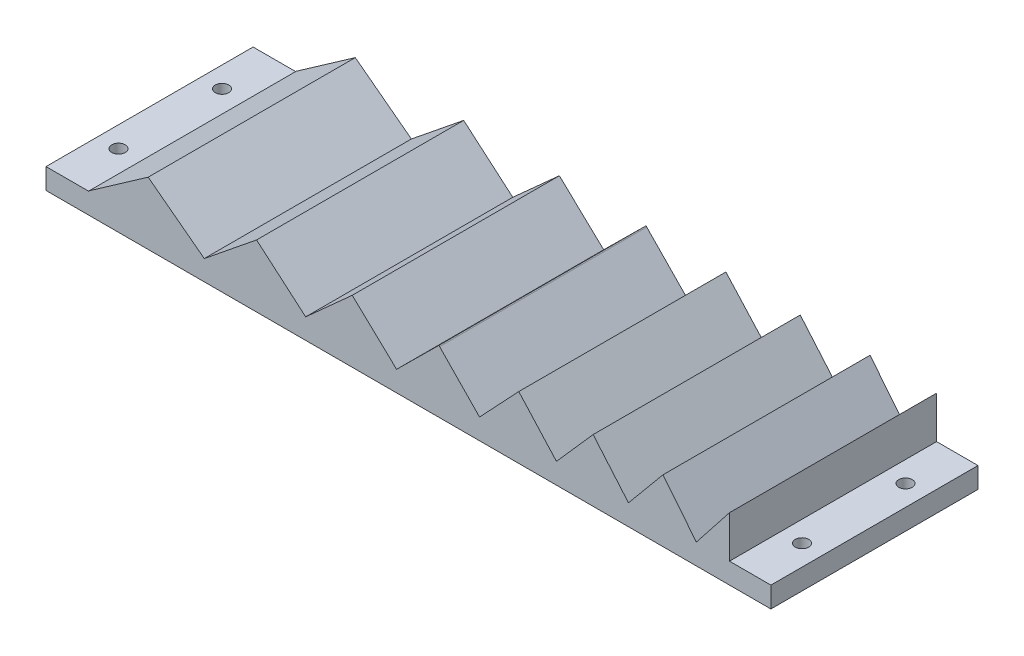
ISO-10303-21;
HEADER;
FILE_DESCRIPTION(('STEP AP214'),'2;1');
FILE_NAME('part.step','',(''),(''),'','','');
FILE_SCHEMA(('AUTOMOTIVE_DESIGN { 1 0 10303 214 1 1 1 1 }'));
ENDSEC;
DATA;
#1=APPLICATION_CONTEXT('core data for automotive mechanical design processes');
#2=APPLICATION_PROTOCOL_DEFINITION('international standard','automotive_design',2000,#1);
#3=PRODUCT_CONTEXT('',#1,'mechanical');
#4=PRODUCT('Part','Part','',(#3));
#5=PRODUCT_RELATED_PRODUCT_CATEGORY('part','',(#4));
#6=PRODUCT_DEFINITION_FORMATION('','',#4);
#7=PRODUCT_DEFINITION_CONTEXT('part definition',#1,'design');
#8=PRODUCT_DEFINITION('design','',#6,#7);
#9=PRODUCT_DEFINITION_SHAPE('','',#8);
#10=(LENGTH_UNIT() NAMED_UNIT(*) SI_UNIT(.MILLI.,.METRE.));
#11=(NAMED_UNIT(*) PLANE_ANGLE_UNIT() SI_UNIT($,.RADIAN.));
#12=(NAMED_UNIT(*) SI_UNIT($,.STERADIAN.) SOLID_ANGLE_UNIT());
#13=UNCERTAINTY_MEASURE_WITH_UNIT(LENGTH_MEASURE(1.E-05),#10,'distance_accuracy_value','');
#14=(GEOMETRIC_REPRESENTATION_CONTEXT(3) GLOBAL_UNCERTAINTY_ASSIGNED_CONTEXT((#13)) GLOBAL_UNIT_ASSIGNED_CONTEXT((#10,
#11,#12)) REPRESENTATION_CONTEXT('',''));
#15=CARTESIAN_POINT('',(0.,0.,0.));
#16=DIRECTION('',(0.,0.,1.));
#17=DIRECTION('',(1.,0.,0.));
#18=AXIS2_PLACEMENT_3D('',#15,#16,#17);
#19=CARTESIAN_POINT('',(0.,0.,100.));
#20=DIRECTION('',(0.,-1.,0.));
#21=DIRECTION('',(0.,0.,-1.));
#22=AXIS2_PLACEMENT_3D('',#19,#20,#21);
#23=PLANE('',#22);
#24=CARTESIAN_POINT('',(-10.,0.,25.));
#25=DIRECTION('',(0.,-1.,0.));
#26=DIRECTION('',(0.,0.,-1.));
#27=AXIS2_PLACEMENT_3D('',#24,#25,#26);
#28=CIRCLE('',#27,3.25);
#29=CARTESIAN_POINT('',(-10.,0.,21.75));
#30=VERTEX_POINT('',#29);
#31=EDGE_CURVE('E234',#30,#30,#28,.T.);
#32=ORIENTED_EDGE('',*,*,#31,.T.);
#33=EDGE_LOOP('',(#32));
#34=FACE_BOUND('',#33,.T.);
#35=CARTESIAN_POINT('',(-10.,0.,75.));
#36=DIRECTION('',(0.,-1.,0.));
#37=DIRECTION('',(0.,0.,-1.));
#38=AXIS2_PLACEMENT_3D('',#35,#36,#37);
#39=CIRCLE('',#38,3.25);
#40=CARTESIAN_POINT('',(-10.,0.,71.75));
#41=VERTEX_POINT('',#40);
#42=EDGE_CURVE('E364',#41,#41,#39,.T.);
#43=ORIENTED_EDGE('',*,*,#42,.T.);
#44=EDGE_LOOP('',(#43));
#45=FACE_BOUND('',#44,.T.);
#46=DIRECTION('',(-1.,0.,0.));
#47=VECTOR('',#46,1.);
#48=CARTESIAN_POINT('',(0.,0.,0.));
#49=LINE('',#48,#47);
#50=CARTESIAN_POINT('',(0.820434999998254,0.,0.));
#51=VERTEX_POINT('',#50);
#52=CARTESIAN_POINT('',(-20.,0.,0.));
#53=VERTEX_POINT('',#52);
#54=EDGE_CURVE('E138',#51,#53,#49,.T.);
#55=ORIENTED_EDGE('',*,*,#54,.T.);
#56=DIRECTION('',(0.,0.,-1.));
#57=VECTOR('',#56,1.);
#58=CARTESIAN_POINT('',(-20.,0.,100.));
#59=LINE('',#58,#57);
#60=CARTESIAN_POINT('',(-20.,0.,100.));
#61=VERTEX_POINT('',#60);
#62=EDGE_CURVE('E11',#61,#53,#59,.T.);
#63=ORIENTED_EDGE('',*,*,#62,.F.);
#64=DIRECTION('',(-1.,0.,0.));
#65=VECTOR('',#64,1.);
#66=CARTESIAN_POINT('',(0.,0.,100.));
#67=LINE('',#66,#65);
#68=CARTESIAN_POINT('',(0.820434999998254,0.,100.));
#69=VERTEX_POINT('',#68);
#70=EDGE_CURVE('E144',#69,#61,#67,.T.);
#71=ORIENTED_EDGE('',*,*,#70,.F.);
#72=DIRECTION('',(0.,0.,-1.));
#73=VECTOR('',#72,1.);
#74=CARTESIAN_POINT('',(0.820434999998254,0.,100.));
#75=LINE('',#74,#73);
#76=EDGE_CURVE('E228',#69,#51,#75,.T.);
#77=ORIENTED_EDGE('',*,*,#76,.T.);
#78=EDGE_LOOP('',(#55,#63,#71,#77));
#79=FACE_BOUND('',#78,.T.);
#80=ADVANCED_FACE('F33',(#34,#45,#79),#23,.F.);
#81=CARTESIAN_POINT('',(-20.,0.,100.));
#82=DIRECTION('',(1.,0.,0.));
#83=DIRECTION('',(0.,0.,-1.));
#84=AXIS2_PLACEMENT_3D('',#81,#82,#83);
#85=PLANE('',#84);
#86=DIRECTION('',(0.,-1.,0.));
#87=VECTOR('',#86,1.);
#88=CARTESIAN_POINT('',(-20.,0.,0.));
#89=LINE('',#88,#87);
#90=CARTESIAN_POINT('',(-20.,-10.,0.));
#91=VERTEX_POINT('',#90);
#92=EDGE_CURVE('E233',#53,#91,#89,.T.);
#93=ORIENTED_EDGE('',*,*,#92,.T.);
#94=DIRECTION('',(0.,0.,-1.));
#95=VECTOR('',#94,1.);
#96=CARTESIAN_POINT('',(-20.,-10.,100.));
#97=LINE('',#96,#95);
#98=CARTESIAN_POINT('',(-20.,-10.,100.));
#99=VERTEX_POINT('',#98);
#100=EDGE_CURVE('E42',#99,#91,#97,.T.);
#101=ORIENTED_EDGE('',*,*,#100,.F.);
#102=DIRECTION('',(0.,-1.,0.));
#103=VECTOR('',#102,1.);
#104=CARTESIAN_POINT('',(-20.,0.,100.));
#105=LINE('',#104,#103);
#106=EDGE_CURVE('E378',#61,#99,#105,.T.);
#107=ORIENTED_EDGE('',*,*,#106,.F.);
#108=ORIENTED_EDGE('',*,*,#62,.T.);
#109=EDGE_LOOP('',(#93,#101,#107,#108));
#110=FACE_BOUND('',#109,.T.);
#111=ADVANCED_FACE('F434',(#110),#85,.F.);
#112=CARTESIAN_POINT('',(-20.,-10.,100.));
#113=DIRECTION('',(0.,1.,0.));
#114=DIRECTION('',(0.,0.,1.));
#115=AXIS2_PLACEMENT_3D('',#112,#113,#114);
#116=PLANE('',#115);
#117=CARTESIAN_POINT('',(320.,-10.,75.));
#118=DIRECTION('',(0.,1.,0.));
#119=DIRECTION('',(0.,0.,1.));
#120=AXIS2_PLACEMENT_3D('',#117,#118,#119);
#121=CIRCLE('',#120,3.25000000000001);
#122=CARTESIAN_POINT('',(320.,-10.,71.75));
#123=VERTEX_POINT('',#122);
#124=EDGE_CURVE('E361',#123,#123,#121,.T.);
#125=ORIENTED_EDGE('',*,*,#124,.T.);
#126=EDGE_LOOP('',(#125));
#127=FACE_BOUND('',#126,.T.);
#128=CARTESIAN_POINT('',(320.,-10.,25.));
#129=DIRECTION('',(0.,1.,0.));
#130=DIRECTION('',(0.,0.,1.));
#131=AXIS2_PLACEMENT_3D('',#128,#129,#130);
#132=CIRCLE('',#131,3.25000000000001);
#133=CARTESIAN_POINT('',(320.,-10.,21.75));
#134=VERTEX_POINT('',#133);
#135=EDGE_CURVE('E358',#134,#134,#132,.T.);
#136=ORIENTED_EDGE('',*,*,#135,.T.);
#137=EDGE_LOOP('',(#136));
#138=FACE_BOUND('',#137,.T.);
#139=CARTESIAN_POINT('',(-10.,-10.,25.));
#140=DIRECTION('',(0.,1.,0.));
#141=DIRECTION('',(0.,0.,1.));
#142=AXIS2_PLACEMENT_3D('',#139,#140,#141);
#143=CIRCLE('',#142,3.25);
#144=CARTESIAN_POINT('',(-10.,-10.,21.75));
#145=VERTEX_POINT('',#144);
#146=EDGE_CURVE('E36',#145,#145,#143,.T.);
#147=ORIENTED_EDGE('',*,*,#146,.T.);
#148=EDGE_LOOP('',(#147));
#149=FACE_BOUND('',#148,.T.);
#150=CARTESIAN_POINT('',(-10.,-10.,75.));
#151=DIRECTION('',(0.,1.,0.));
#152=DIRECTION('',(0.,0.,1.));
#153=AXIS2_PLACEMENT_3D('',#150,#151,#152);
#154=CIRCLE('',#153,3.25);
#155=CARTESIAN_POINT('',(-10.,-10.,71.75));
#156=VERTEX_POINT('',#155);
#157=EDGE_CURVE('E362',#156,#156,#154,.T.);
#158=ORIENTED_EDGE('',*,*,#157,.T.);
#159=EDGE_LOOP('',(#158));
#160=FACE_BOUND('',#159,.T.);
#161=DIRECTION('',(1.,0.,0.));
#162=VECTOR('',#161,1.);
#163=CARTESIAN_POINT('',(-20.,-10.,0.));
#164=LINE('',#163,#162);
#165=CARTESIAN_POINT('',(330.,-10.,0.));
#166=VERTEX_POINT('',#165);
#167=EDGE_CURVE('E236',#91,#166,#164,.T.);
#168=ORIENTED_EDGE('',*,*,#167,.T.);
#169=DIRECTION('',(0.,0.,-1.));
#170=VECTOR('',#169,1.);
#171=CARTESIAN_POINT('',(330.,-10.,100.));
#172=LINE('',#171,#170);
#173=CARTESIAN_POINT('',(330.,-10.,100.));
#174=VERTEX_POINT('',#173);
#175=EDGE_CURVE('E350',#174,#166,#172,.T.);
#176=ORIENTED_EDGE('',*,*,#175,.F.);
#177=DIRECTION('',(1.,0.,0.));
#178=VECTOR('',#177,1.);
#179=CARTESIAN_POINT('',(-20.,-10.,100.));
#180=LINE('',#179,#178);
#181=EDGE_CURVE('E380',#99,#174,#180,.T.);
#182=ORIENTED_EDGE('',*,*,#181,.F.);
#183=ORIENTED_EDGE('',*,*,#100,.T.);
#184=EDGE_LOOP('',(#168,#176,#182,#183));
#185=FACE_BOUND('',#184,.T.);
#186=ADVANCED_FACE('F440',(#127,#138,#149,#160,#185),#116,.F.);
#187=CARTESIAN_POINT('',(330.,-10.,100.));
#188=DIRECTION('',(-1.,0.,0.));
#189=DIRECTION('',(0.,0.,1.));
#190=AXIS2_PLACEMENT_3D('',#187,#188,#189);
#191=PLANE('',#190);
#192=DIRECTION('',(0.,1.,0.));
#193=VECTOR('',#192,1.);
#194=CARTESIAN_POINT('',(330.,-10.,0.));
#195=LINE('',#194,#193);
#196=CARTESIAN_POINT('',(330.,0.,0.));
#197=VERTEX_POINT('',#196);
#198=EDGE_CURVE('E238',#166,#197,#195,.T.);
#199=ORIENTED_EDGE('',*,*,#198,.T.);
#200=DIRECTION('',(0.,0.,-1.));
#201=VECTOR('',#200,1.);
#202=CARTESIAN_POINT('',(330.,0.,100.));
#203=LINE('',#202,#201);
#204=CARTESIAN_POINT('',(330.,0.,100.));
#205=VERTEX_POINT('',#204);
#206=EDGE_CURVE('E347',#205,#197,#203,.T.);
#207=ORIENTED_EDGE('',*,*,#206,.F.);
#208=DIRECTION('',(0.,1.,0.));
#209=VECTOR('',#208,1.);
#210=CARTESIAN_POINT('',(330.,-10.,100.));
#211=LINE('',#210,#209);
#212=EDGE_CURVE('E382',#174,#205,#211,.T.);
#213=ORIENTED_EDGE('',*,*,#212,.F.);
#214=ORIENTED_EDGE('',*,*,#175,.T.);
#215=EDGE_LOOP('',(#199,#207,#213,#214));
#216=FACE_BOUND('',#215,.T.);
#217=ADVANCED_FACE('F444',(#216),#191,.F.);
#218=CARTESIAN_POINT('',(330.,0.,100.));
#219=DIRECTION('',(0.,-1.,0.));
#220=DIRECTION('',(1.,0.,0.));
#221=AXIS2_PLACEMENT_3D('',#218,#219,#220);
#222=PLANE('',#221);
#223=CARTESIAN_POINT('',(320.,0.,75.));
#224=DIRECTION('',(0.,-1.,0.));
#225=DIRECTION('',(1.,0.,0.));
#226=AXIS2_PLACEMENT_3D('',#223,#224,#225);
#227=CIRCLE('',#226,3.25000000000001);
#228=CARTESIAN_POINT('',(320.,0.,71.75));
#229=VERTEX_POINT('',#228);
#230=EDGE_CURVE('E359',#229,#229,#227,.T.);
#231=ORIENTED_EDGE('',*,*,#230,.T.);
#232=EDGE_LOOP('',(#231));
#233=FACE_BOUND('',#232,.T.);
#234=CARTESIAN_POINT('',(320.,0.,25.));
#235=DIRECTION('',(0.,-1.,0.));
#236=DIRECTION('',(1.,0.,0.));
#237=AXIS2_PLACEMENT_3D('',#234,#235,#236);
#238=CIRCLE('',#237,3.25000000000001);
#239=CARTESIAN_POINT('',(320.,0.,21.75));
#240=VERTEX_POINT('',#239);
#241=EDGE_CURVE('E355',#240,#240,#238,.T.);
#242=ORIENTED_EDGE('',*,*,#241,.T.);
#243=EDGE_LOOP('',(#242));
#244=FACE_BOUND('',#243,.T.);
#245=DIRECTION('',(-1.,0.,0.));
#246=VECTOR('',#245,1.);
#247=CARTESIAN_POINT('',(330.,0.,0.));
#248=LINE('',#247,#246);
#249=CARTESIAN_POINT('',(310.,0.,0.));
#250=VERTEX_POINT('',#249);
#251=EDGE_CURVE('E240',#197,#250,#248,.T.);
#252=ORIENTED_EDGE('',*,*,#251,.T.);
#253=DIRECTION('',(0.,0.,-1.));
#254=VECTOR('',#253,1.);
#255=CARTESIAN_POINT('',(310.,0.,100.));
#256=LINE('',#255,#254);
#257=CARTESIAN_POINT('',(310.,0.,100.));
#258=VERTEX_POINT('',#257);
#259=EDGE_CURVE('E344',#258,#250,#256,.T.);
#260=ORIENTED_EDGE('',*,*,#259,.F.);
#261=DIRECTION('',(-1.,0.,0.));
#262=VECTOR('',#261,1.);
#263=CARTESIAN_POINT('',(330.,0.,100.));
#264=LINE('',#263,#262);
#265=EDGE_CURVE('E384',#205,#258,#264,.T.);
#266=ORIENTED_EDGE('',*,*,#265,.F.);
#267=ORIENTED_EDGE('',*,*,#206,.T.);
#268=EDGE_LOOP('',(#252,#260,#266,#267));
#269=FACE_BOUND('',#268,.T.);
#270=ADVANCED_FACE('F449',(#233,#244,#269),#222,.F.);
#271=CARTESIAN_POINT('',(310.,0.,100.));
#272=DIRECTION('',(-1.,0.,0.));
#273=DIRECTION('',(0.,-1.,0.));
#274=AXIS2_PLACEMENT_3D('',#271,#272,#273);
#275=PLANE('',#274);
#276=DIRECTION('',(0.,1.,0.));
#277=VECTOR('',#276,1.);
#278=CARTESIAN_POINT('',(310.,0.,0.));
#279=LINE('',#278,#277);
#280=CARTESIAN_POINT('',(309.999999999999,20.2679736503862,0.));
#281=VERTEX_POINT('',#280);
#282=EDGE_CURVE('E242',#250,#281,#279,.T.);
#283=ORIENTED_EDGE('',*,*,#282,.T.);
#284=DIRECTION('',(0.,0.,-1.));
#285=VECTOR('',#284,1.);
#286=CARTESIAN_POINT('',(309.999999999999,20.2679736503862,100.));
#287=LINE('',#286,#285);
#288=CARTESIAN_POINT('',(309.999999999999,20.2679736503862,100.));
#289=VERTEX_POINT('',#288);
#290=EDGE_CURVE('E341',#289,#281,#287,.T.);
#291=ORIENTED_EDGE('',*,*,#290,.F.);
#292=DIRECTION('',(0.,1.,0.));
#293=VECTOR('',#292,1.);
#294=CARTESIAN_POINT('',(310.,0.,100.));
#295=LINE('',#294,#293);
#296=EDGE_CURVE('E386',#258,#289,#295,.T.);
#297=ORIENTED_EDGE('',*,*,#296,.F.);
#298=ORIENTED_EDGE('',*,*,#259,.T.);
#299=EDGE_LOOP('',(#283,#291,#297,#298));
#300=FACE_BOUND('',#299,.T.);
#301=ADVANCED_FACE('F455',(#300),#275,.F.);
#302=CARTESIAN_POINT('',(294.213976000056,0.241180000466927,100.));
#303=DIRECTION('',(0.785351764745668,-0.619049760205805,0.));
#304=DIRECTION('',(0.619049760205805,0.785351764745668,0.));
#305=AXIS2_PLACEMENT_3D('',#302,#303,#304);
#306=PLANE('',#305);
#307=DIRECTION('',(-0.619049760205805,-0.785351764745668,0.));
#308=VECTOR('',#307,1.);
#309=CARTESIAN_POINT('',(294.213976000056,0.241180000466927,0.));
#310=LINE('',#309,#308);
#311=CARTESIAN_POINT('',(294.016002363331,-0.00997742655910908,0.));
#312=VERTEX_POINT('',#311);
#313=EDGE_CURVE('E245',#281,#312,#310,.T.);
#314=ORIENTED_EDGE('',*,*,#313,.T.);
#315=DIRECTION('',(0.,0.,-1.));
#316=VECTOR('',#315,1.);
#317=CARTESIAN_POINT('',(294.016002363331,-0.00997742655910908,100.));
#318=LINE('',#317,#316);
#319=CARTESIAN_POINT('',(294.016002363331,-0.00997742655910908,100.));
#320=VERTEX_POINT('',#319);
#321=EDGE_CURVE('E338',#320,#312,#318,.T.);
#322=ORIENTED_EDGE('',*,*,#321,.F.);
#323=DIRECTION('',(-0.619049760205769,-0.785351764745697,0.));
#324=VECTOR('',#323,1.);
#325=CARTESIAN_POINT('',(309.580239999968,19.7354490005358,100.));
#326=LINE('',#325,#324);
#327=EDGE_CURVE('E388',#289,#320,#326,.T.);
#328=ORIENTED_EDGE('',*,*,#327,.F.);
#329=ORIENTED_EDGE('',*,*,#290,.T.);
#330=EDGE_LOOP('',(#314,#322,#328,#329));
#331=FACE_BOUND('',#330,.T.);
#332=ADVANCED_FACE('F458',(#331),#306,.F.);
#333=CARTESIAN_POINT('',(278.130607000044,19.740846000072,100.));
#334=DIRECTION('',(-0.779235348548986,-0.626731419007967,0.));
#335=DIRECTION('',(0.626731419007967,-0.779235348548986,0.));
#336=AXIS2_PLACEMENT_3D('',#333,#334,#335);
#337=PLANE('',#336);
#338=DIRECTION('',(-0.626731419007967,0.779235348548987,0.));
#339=VECTOR('',#338,1.);
#340=CARTESIAN_POINT('',(278.130607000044,19.740846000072,0.));
#341=LINE('',#340,#339);
#342=CARTESIAN_POINT('',(277.88195078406,20.0500082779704,0.));
#343=VERTEX_POINT('',#342);
#344=EDGE_CURVE('E248',#312,#343,#341,.T.);
#345=ORIENTED_EDGE('',*,*,#344,.T.);
#346=DIRECTION('',(0.,0.,-1.));
#347=VECTOR('',#346,1.);
#348=CARTESIAN_POINT('',(277.88195078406,20.0500082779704,100.));
#349=LINE('',#348,#347);
#350=CARTESIAN_POINT('',(277.88195078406,20.0500082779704,100.));
#351=VERTEX_POINT('',#350);
#352=EDGE_CURVE('E335',#351,#343,#349,.T.);
#353=ORIENTED_EDGE('',*,*,#352,.F.);
#354=DIRECTION('',(-0.626731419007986,0.779235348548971,0.));
#355=VECTOR('',#354,1.);
#356=CARTESIAN_POINT('',(293.804196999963,0.253367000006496,100.));
#357=LINE('',#356,#355);
#358=EDGE_CURVE('E390',#320,#351,#357,.T.);
#359=ORIENTED_EDGE('',*,*,#358,.F.);
#360=ORIENTED_EDGE('',*,*,#321,.T.);
#361=EDGE_LOOP('',(#345,#353,#359,#360));
#362=FACE_BOUND('',#361,.T.);
#363=ADVANCED_FACE('F462',(#362),#337,.F.);
#364=CARTESIAN_POINT('',(277.88195078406,20.0500082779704,100.));
#365=DIRECTION('',(0.75964786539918,-0.650334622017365,0.));
#366=DIRECTION('',(0.650334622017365,0.75964786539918,0.));
#367=AXIS2_PLACEMENT_3D('',#364,#365,#366);
#368=PLANE('',#367);
#369=DIRECTION('',(-0.650334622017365,-0.75964786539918,0.));
#370=VECTOR('',#369,1.);
#371=CARTESIAN_POINT('',(277.88195078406,20.0500082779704,0.));
#372=LINE('',#371,#370);
#373=CARTESIAN_POINT('',(277.868358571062,20.0341313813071,0.));
#374=VERTEX_POINT('',#373);
#375=EDGE_CURVE('E250',#343,#374,#372,.T.);
#376=ORIENTED_EDGE('',*,*,#375,.T.);
#377=DIRECTION('',(0.,0.,-1.));
#378=VECTOR('',#377,1.);
#379=CARTESIAN_POINT('',(277.868358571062,20.0341313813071,100.));
#380=LINE('',#379,#378);
#381=CARTESIAN_POINT('',(277.868358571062,20.0341313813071,100.));
#382=VERTEX_POINT('',#381);
#383=EDGE_CURVE('E332',#382,#374,#380,.T.);
#384=ORIENTED_EDGE('',*,*,#383,.F.);
#385=DIRECTION('',(-0.650334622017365,-0.75964786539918,0.));
#386=VECTOR('',#385,1.);
#387=CARTESIAN_POINT('',(277.88195078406,20.0500082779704,100.));
#388=LINE('',#387,#386);
#389=EDGE_CURVE('E392',#351,#382,#388,.T.);
#390=ORIENTED_EDGE('',*,*,#389,.F.);
#391=ORIENTED_EDGE('',*,*,#352,.T.);
#392=EDGE_LOOP('',(#376,#384,#390,#391));
#393=FACE_BOUND('',#392,.T.);
#394=ADVANCED_FACE('F468',(#393),#368,.F.);
#395=CARTESIAN_POINT('',(261.432553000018,0.241466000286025,100.));
#396=DIRECTION('',(0.769330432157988,-0.638851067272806,0.));
#397=DIRECTION('',(0.638851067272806,0.769330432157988,0.));
#398=AXIS2_PLACEMENT_3D('',#395,#396,#397);
#399=PLANE('',#398);
#400=DIRECTION('',(-0.638851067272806,-0.769330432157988,0.));
#401=VECTOR('',#400,1.);
#402=CARTESIAN_POINT('',(261.432553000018,0.241466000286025,0.));
#403=LINE('',#402,#401);
#404=CARTESIAN_POINT('',(261.234330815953,0.00275878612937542,0.));
#405=VERTEX_POINT('',#404);
#406=EDGE_CURVE('E253',#374,#405,#403,.T.);
#407=ORIENTED_EDGE('',*,*,#406,.T.);
#408=DIRECTION('',(0.,0.,-1.));
#409=VECTOR('',#408,1.);
#410=CARTESIAN_POINT('',(261.234330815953,0.00275878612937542,100.));
#411=LINE('',#410,#409);
#412=CARTESIAN_POINT('',(261.234330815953,0.00275878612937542,100.));
#413=VERTEX_POINT('',#412);
#414=EDGE_CURVE('E329',#413,#405,#411,.T.);
#415=ORIENTED_EDGE('',*,*,#414,.F.);
#416=DIRECTION('',(-0.638851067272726,-0.769330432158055,0.));
#417=VECTOR('',#416,1.);
#418=CARTESIAN_POINT('',(277.618375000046,19.733091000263,100.));
#419=LINE('',#418,#417);
#420=EDGE_CURVE('E394',#382,#413,#419,.T.);
#421=ORIENTED_EDGE('',*,*,#420,.F.);
#422=ORIENTED_EDGE('',*,*,#383,.T.);
#423=EDGE_LOOP('',(#407,#415,#421,#422));
#424=FACE_BOUND('',#423,.T.);
#425=ADVANCED_FACE('F471',(#424),#399,.F.);
#426=CARTESIAN_POINT('',(244.427210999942,19.7398100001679,100.));
#427=DIRECTION('',(-0.761356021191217,-0.648334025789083,0.));
#428=DIRECTION('',(0.648334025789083,-0.761356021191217,0.));
#429=AXIS2_PLACEMENT_3D('',#426,#427,#428);
#430=PLANE('',#429);
#431=DIRECTION('',(-0.648334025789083,0.761356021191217,0.));
#432=VECTOR('',#431,1.);
#433=CARTESIAN_POINT('',(244.427210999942,19.7398100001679,0.));
#434=LINE('',#433,#432);
#435=CARTESIAN_POINT('',(244.176581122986,20.0341313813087,0.));
#436=VERTEX_POINT('',#435);
#437=EDGE_CURVE('E256',#405,#436,#434,.T.);
#438=ORIENTED_EDGE('',*,*,#437,.T.);
#439=DIRECTION('',(0.,0.,-1.));
#440=VECTOR('',#439,1.);
#441=CARTESIAN_POINT('',(244.176581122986,20.0341313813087,100.));
#442=LINE('',#441,#440);
#443=CARTESIAN_POINT('',(244.176581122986,20.0341313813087,100.));
#444=VERTEX_POINT('',#443);
#445=EDGE_CURVE('E326',#444,#436,#442,.T.);
#446=ORIENTED_EDGE('',*,*,#445,.F.);
#447=DIRECTION('',(-0.648334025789,0.761356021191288,0.));
#448=VECTOR('',#447,1.);
#449=CARTESIAN_POINT('',(261.02281199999,0.25115100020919,100.));
#450=LINE('',#449,#448);
#451=EDGE_CURVE('E396',#413,#444,#450,.T.);
#452=ORIENTED_EDGE('',*,*,#451,.F.);
#453=ORIENTED_EDGE('',*,*,#414,.T.);
#454=EDGE_LOOP('',(#438,#446,#452,#453));
#455=FACE_BOUND('',#454,.T.);
#456=ADVANCED_FACE('F475',(#455),#430,.F.);
#457=CARTESIAN_POINT('',(226.704766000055,0.242967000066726,100.));
#458=DIRECTION('',(0.749668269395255,-0.661813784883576,0.));
#459=DIRECTION('',(0.661813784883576,0.749668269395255,0.));
#460=AXIS2_PLACEMENT_3D('',#457,#458,#459);
#461=PLANE('',#460);
#462=DIRECTION('',(-0.661813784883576,-0.749668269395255,0.));
#463=VECTOR('',#462,1.);
#464=CARTESIAN_POINT('',(226.704766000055,0.242967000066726,0.));
#465=LINE('',#464,#463);
#466=CARTESIAN_POINT('',(226.457367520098,-0.0372731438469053,0.));
#467=VERTEX_POINT('',#466);
#468=EDGE_CURVE('E259',#436,#467,#465,.T.);
#469=ORIENTED_EDGE('',*,*,#468,.T.);
#470=DIRECTION('',(0.,0.,-1.));
#471=VECTOR('',#470,1.);
#472=CARTESIAN_POINT('',(226.457367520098,-0.0372731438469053,100.));
#473=LINE('',#472,#471);
#474=CARTESIAN_POINT('',(226.457367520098,-0.0372731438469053,100.));
#475=VERTEX_POINT('',#474);
#476=EDGE_CURVE('E323',#475,#467,#473,.T.);
#477=ORIENTED_EDGE('',*,*,#476,.F.);
#478=DIRECTION('',(-0.661813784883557,-0.749668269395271,0.));
#479=VECTOR('',#478,1.);
#480=CARTESIAN_POINT('',(243.915015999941,19.7378440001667,100.));
#481=LINE('',#480,#479);
#482=EDGE_CURVE('E398',#444,#475,#481,.T.);
#483=ORIENTED_EDGE('',*,*,#482,.F.);
#484=ORIENTED_EDGE('',*,*,#445,.T.);
#485=EDGE_LOOP('',(#469,#477,#483,#484));
#486=FACE_BOUND('',#485,.T.);
#487=ADVANCED_FACE('F481',(#486),#461,.F.);
#488=CARTESIAN_POINT('',(208.572580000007,19.7378440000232,100.));
#489=DIRECTION('',(-0.741666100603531,-0.67076925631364,0.));
#490=DIRECTION('',(0.67076925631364,-0.741666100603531,0.));
#491=AXIS2_PLACEMENT_3D('',#488,#489,#490);
#492=PLANE('',#491);
#493=DIRECTION('',(-0.67076925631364,0.741666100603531,0.));
#494=VECTOR('',#493,1.);
#495=CARTESIAN_POINT('',(208.572580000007,19.7378440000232,0.));
#496=LINE('',#495,#494);
#497=CARTESIAN_POINT('',(208.27321427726,20.0688511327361,0.));
#498=VERTEX_POINT('',#497);
#499=EDGE_CURVE('E262',#467,#498,#496,.T.);
#500=ORIENTED_EDGE('',*,*,#499,.T.);
#501=DIRECTION('',(0.,0.,-1.));
#502=VECTOR('',#501,1.);
#503=CARTESIAN_POINT('',(208.27321427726,20.0688511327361,100.));
#504=LINE('',#503,#502);
#505=CARTESIAN_POINT('',(208.27321427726,20.0688511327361,100.));
#506=VERTEX_POINT('',#505);
#507=EDGE_CURVE('E320',#506,#498,#504,.T.);
#508=ORIENTED_EDGE('',*,*,#507,.F.);
#509=DIRECTION('',(-0.670769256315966,0.741666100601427,0.));
#510=VECTOR('',#509,1.);
#511=CARTESIAN_POINT('',(226.192571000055,0.255511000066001,100.));
#512=LINE('',#511,#510);
#513=EDGE_CURVE('E400',#475,#506,#512,.T.);
#514=ORIENTED_EDGE('',*,*,#513,.F.);
#515=ORIENTED_EDGE('',*,*,#476,.T.);
#516=EDGE_LOOP('',(#500,#508,#514,#515));
#517=FACE_BOUND('',#516,.T.);
#518=ADVANCED_FACE('F483',(#517),#492,.F.);
#519=CARTESIAN_POINT('',(189.620837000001,0.245219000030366,100.));
#520=DIRECTION('',(0.728294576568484,-0.685264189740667,0.));
#521=DIRECTION('',(0.685264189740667,0.728294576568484,0.));
#522=AXIS2_PLACEMENT_3D('',#519,#520,#521);
#523=PLANE('',#522);
#524=DIRECTION('',(-0.685264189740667,-0.728294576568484,0.));
#525=VECTOR('',#524,1.);
#526=CARTESIAN_POINT('',(189.620837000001,0.245219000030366,0.));
#527=LINE('',#526,#525);
#528=CARTESIAN_POINT('',(189.324464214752,-0.0697641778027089,0.));
#529=VERTEX_POINT('',#528);
#530=EDGE_CURVE('E265',#498,#529,#527,.T.);
#531=ORIENTED_EDGE('',*,*,#530,.T.);
#532=DIRECTION('',(0.,0.,-1.));
#533=VECTOR('',#532,1.);
#534=CARTESIAN_POINT('',(189.324464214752,-0.0697641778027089,100.));
#535=LINE('',#534,#533);
#536=CARTESIAN_POINT('',(189.324464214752,-0.0697641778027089,100.));
#537=VERTEX_POINT('',#536);
#538=EDGE_CURVE('E317',#537,#529,#535,.T.);
#539=ORIENTED_EDGE('',*,*,#538,.F.);
#540=DIRECTION('',(-0.685264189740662,-0.728294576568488,0.));
#541=VECTOR('',#540,1.);
#542=CARTESIAN_POINT('',(207.957931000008,19.733770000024,100.));
#543=LINE('',#542,#541);
#544=EDGE_CURVE('E402',#506,#537,#543,.T.);
#545=ORIENTED_EDGE('',*,*,#544,.F.);
#546=ORIENTED_EDGE('',*,*,#507,.T.);
#547=EDGE_LOOP('',(#531,#539,#545,#546));
#548=FACE_BOUND('',#547,.T.);
#549=ADVANCED_FACE('F487',(#548),#523,.F.);
#550=CARTESIAN_POINT('',(170.054408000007,19.7385940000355,100.));
#551=DIRECTION('',(-0.716779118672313,-0.697300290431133,0.));
#552=DIRECTION('',(0.697300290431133,-0.716779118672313,0.));
#553=AXIS2_PLACEMENT_3D('',#550,#551,#552);
#554=PLANE('',#553);
#555=DIRECTION('',(-0.697300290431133,0.716779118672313,0.));
#556=VECTOR('',#555,1.);
#557=CARTESIAN_POINT('',(170.054408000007,19.7385940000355,0.));
#558=LINE('',#557,#556);
#559=CARTESIAN_POINT('',(170.054408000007,19.7385940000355,0.));
#560=VERTEX_POINT('',#559);
#561=EDGE_CURVE('E268',#529,#560,#558,.T.);
#562=ORIENTED_EDGE('',*,*,#561,.T.);
#563=DIRECTION('',(0.,0.,-1.));
#564=VECTOR('',#563,1.);
#565=CARTESIAN_POINT('',(170.054408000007,19.7385940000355,100.));
#566=LINE('',#565,#564);
#567=CARTESIAN_POINT('',(170.054408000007,19.7385940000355,100.));
#568=VERTEX_POINT('',#567);
#569=EDGE_CURVE('E314',#568,#560,#566,.T.);
#570=ORIENTED_EDGE('',*,*,#569,.F.);
#571=DIRECTION('',(-0.697300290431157,0.716779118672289,0.));
#572=VECTOR('',#571,1.);
#573=CARTESIAN_POINT('',(189.006150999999,0.257441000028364,100.));
#574=LINE('',#573,#572);
#575=EDGE_CURVE('E404',#537,#568,#574,.T.);
#576=ORIENTED_EDGE('',*,*,#575,.F.);
#577=ORIENTED_EDGE('',*,*,#538,.T.);
#578=EDGE_LOOP('',(#562,#570,#576,#577));
#579=FACE_BOUND('',#578,.T.);
#580=ADVANCED_FACE('F493',(#579),#554,.F.);
#581=CARTESIAN_POINT('',(170.054408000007,19.7385940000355,100.));
#582=DIRECTION('',(-0.710604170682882,-0.70359200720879,0.));
#583=DIRECTION('',(0.70359200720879,-0.710604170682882,0.));
#584=AXIS2_PLACEMENT_3D('',#581,#582,#583);
#585=PLANE('',#584);
#586=DIRECTION('',(-0.70359200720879,0.710604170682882,0.));
#587=VECTOR('',#586,1.);
#588=CARTESIAN_POINT('',(170.054408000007,19.7385940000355,0.));
#589=LINE('',#588,#587);
#590=CARTESIAN_POINT('',(169.704594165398,20.0918941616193,0.));
#591=VERTEX_POINT('',#590);
#592=EDGE_CURVE('E270',#560,#591,#589,.T.);
#593=ORIENTED_EDGE('',*,*,#592,.T.);
#594=DIRECTION('',(0.,0.,-1.));
#595=VECTOR('',#594,1.);
#596=CARTESIAN_POINT('',(169.704594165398,20.0918941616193,100.));
#597=LINE('',#596,#595);
#598=CARTESIAN_POINT('',(169.704594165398,20.0918941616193,100.));
#599=VERTEX_POINT('',#598);
#600=EDGE_CURVE('E311',#599,#591,#597,.T.);
#601=ORIENTED_EDGE('',*,*,#600,.F.);
#602=DIRECTION('',(-0.70359200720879,0.710604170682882,0.));
#603=VECTOR('',#602,1.);
#604=CARTESIAN_POINT('',(170.054408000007,19.7385940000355,100.));
#605=LINE('',#604,#603);
#606=EDGE_CURVE('E406',#568,#599,#605,.T.);
#607=ORIENTED_EDGE('',*,*,#606,.F.);
#608=ORIENTED_EDGE('',*,*,#569,.T.);
#609=EDGE_LOOP('',(#593,#601,#607,#608));
#610=FACE_BOUND('',#609,.T.);
#611=ADVANCED_FACE('F496',(#610),#585,.F.);
#612=CARTESIAN_POINT('',(149.668496,0.253510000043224,100.));
#613=DIRECTION('',(0.703592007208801,-0.710604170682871,0.));
#614=DIRECTION('',(0.710604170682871,0.703592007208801,0.));
#615=AXIS2_PLACEMENT_3D('',#612,#613,#614);
#616=PLANE('',#615);
#617=DIRECTION('',(-0.710604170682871,-0.703592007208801,0.));
#618=VECTOR('',#617,1.);
#619=CARTESIAN_POINT('',(149.668496,0.253510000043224,0.));
#620=LINE('',#619,#618);
#621=CARTESIAN_POINT('',(149.668496,0.253510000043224,0.));
#622=VERTEX_POINT('',#621);
#623=EDGE_CURVE('E273',#591,#622,#620,.T.);
#624=ORIENTED_EDGE('',*,*,#623,.T.);
#625=DIRECTION('',(0.,0.,-1.));
#626=VECTOR('',#625,1.);
#627=CARTESIAN_POINT('',(149.668496,0.253510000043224,100.));
#628=LINE('',#627,#626);
#629=CARTESIAN_POINT('',(149.668496,0.253510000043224,100.));
#630=VERTEX_POINT('',#629);
#631=EDGE_CURVE('E308',#630,#622,#628,.T.);
#632=ORIENTED_EDGE('',*,*,#631,.F.);
#633=DIRECTION('',(-0.710604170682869,-0.703592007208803,0.));
#634=VECTOR('',#633,1.);
#635=CARTESIAN_POINT('',(169.337342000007,19.7282660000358,100.));
#636=LINE('',#635,#634);
#637=EDGE_CURVE('E408',#599,#630,#636,.T.);
#638=ORIENTED_EDGE('',*,*,#637,.F.);
#639=ORIENTED_EDGE('',*,*,#600,.T.);
#640=EDGE_LOOP('',(#624,#632,#638,#639));
#641=FACE_BOUND('',#640,.T.);
#642=ADVANCED_FACE('F500',(#641),#616,.F.);
#643=CARTESIAN_POINT('',(149.668496,0.253510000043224,100.));
#644=DIRECTION('',(0.726501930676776,-0.687164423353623,0.));
#645=DIRECTION('',(0.687164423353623,0.726501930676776,0.));
#646=AXIS2_PLACEMENT_3D('',#643,#644,#645);
#647=PLANE('',#646);
#648=DIRECTION('',(-0.687164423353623,-0.726501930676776,0.));
#649=VECTOR('',#648,1.);
#650=CARTESIAN_POINT('',(149.668496,0.253510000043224,0.));
#651=LINE('',#650,#649);
#652=CARTESIAN_POINT('',(149.285305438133,-0.151616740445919,0.));
#653=VERTEX_POINT('',#652);
#654=EDGE_CURVE('E275',#622,#653,#651,.T.);
#655=ORIENTED_EDGE('',*,*,#654,.T.);
#656=DIRECTION('',(0.,0.,-1.));
#657=VECTOR('',#656,1.);
#658=CARTESIAN_POINT('',(149.285305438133,-0.151616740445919,100.));
#659=LINE('',#658,#657);
#660=CARTESIAN_POINT('',(149.285305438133,-0.151616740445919,100.));
#661=VERTEX_POINT('',#660);
#662=EDGE_CURVE('E305',#661,#653,#659,.T.);
#663=ORIENTED_EDGE('',*,*,#662,.F.);
#664=DIRECTION('',(-0.687164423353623,-0.726501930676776,0.));
#665=VECTOR('',#664,1.);
#666=CARTESIAN_POINT('',(149.668496,0.253510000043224,100.));
#667=LINE('',#666,#665);
#668=EDGE_CURVE('E410',#630,#661,#667,.T.);
#669=ORIENTED_EDGE('',*,*,#668,.F.);
#670=ORIENTED_EDGE('',*,*,#631,.T.);
#671=EDGE_LOOP('',(#655,#663,#669,#670));
#672=FACE_BOUND('',#671,.T.);
#673=ADVANCED_FACE('F506',(#672),#647,.F.);
#674=CARTESIAN_POINT('',(148.848939,0.261122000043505,100.));
#675=DIRECTION('',(-0.687164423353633,-0.726501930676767,0.));
#676=DIRECTION('',(0.726501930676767,-0.687164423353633,0.));
#677=AXIS2_PLACEMENT_3D('',#674,#675,#676);
#678=PLANE('',#677);
#679=DIRECTION('',(-0.726501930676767,0.687164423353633,0.));
#680=VECTOR('',#679,1.);
#681=CARTESIAN_POINT('',(148.848939,0.261122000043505,0.));
#682=LINE('',#681,#680);
#683=CARTESIAN_POINT('',(127.863307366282,20.1104559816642,0.));
#684=VERTEX_POINT('',#683);
#685=EDGE_CURVE('E278',#653,#684,#682,.T.);
#686=ORIENTED_EDGE('',*,*,#685,.T.);
#687=DIRECTION('',(0.,0.,-1.));
#688=VECTOR('',#687,1.);
#689=CARTESIAN_POINT('',(127.863307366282,20.1104559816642,100.));
#690=LINE('',#689,#688);
#691=CARTESIAN_POINT('',(127.863307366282,20.1104559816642,100.));
#692=VERTEX_POINT('',#691);
#693=EDGE_CURVE('E302',#692,#684,#690,.T.);
#694=ORIENTED_EDGE('',*,*,#693,.F.);
#695=DIRECTION('',(-0.726501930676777,0.687164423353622,0.));
#696=VECTOR('',#695,1.);
#697=CARTESIAN_POINT('',(149.285305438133,-0.151616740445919,100.));
#698=LINE('',#697,#696);
#699=EDGE_CURVE('E412',#661,#692,#698,.T.);
#700=ORIENTED_EDGE('',*,*,#699,.F.);
#701=ORIENTED_EDGE('',*,*,#662,.T.);
#702=EDGE_LOOP('',(#686,#694,#700,#701));
#703=FACE_BOUND('',#702,.T.);
#704=ADVANCED_FACE('F509',(#703),#678,.F.);
#705=CARTESIAN_POINT('',(105.380729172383,-0.145962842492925,100.));
#706=DIRECTION('',(0.669368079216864,-0.74293093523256,0.));
#707=DIRECTION('',(0.74293093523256,0.669368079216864,0.));
#708=AXIS2_PLACEMENT_3D('',#705,#706,#707);
#709=PLANE('',#708);
#710=DIRECTION('',(-0.742930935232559,-0.669368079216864,0.));
#711=VECTOR('',#710,1.);
#712=CARTESIAN_POINT('',(105.380729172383,-0.145962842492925,0.));
#713=LINE('',#712,#711);
#714=CARTESIAN_POINT('',(105.380729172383,-0.145962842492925,0.));
#715=VERTEX_POINT('',#714);
#716=EDGE_CURVE('E280',#684,#715,#713,.T.);
#717=ORIENTED_EDGE('',*,*,#716,.T.);
#718=DIRECTION('',(0.,0.,-1.));
#719=VECTOR('',#718,1.);
#720=CARTESIAN_POINT('',(105.380729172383,-0.145962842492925,100.));
#721=LINE('',#720,#719);
#722=CARTESIAN_POINT('',(105.380729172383,-0.145962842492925,100.));
#723=VERTEX_POINT('',#722);
#724=EDGE_CURVE('E299',#723,#715,#721,.T.);
#725=ORIENTED_EDGE('',*,*,#724,.F.);
#726=DIRECTION('',(-0.742930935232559,-0.669368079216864,0.));
#727=VECTOR('',#726,1.);
#728=CARTESIAN_POINT('',(105.380729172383,-0.145962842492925,100.));
#729=LINE('',#728,#727);
#730=EDGE_CURVE('E414',#692,#723,#729,.T.);
#731=ORIENTED_EDGE('',*,*,#730,.F.);
#732=ORIENTED_EDGE('',*,*,#693,.T.);
#733=EDGE_LOOP('',(#717,#725,#731,#732));
#734=FACE_BOUND('',#733,.T.);
#735=ADVANCED_FACE('F511',(#734),#709,.F.);
#736=CARTESIAN_POINT('',(81.6659850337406,20.1545131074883,100.));
#737=DIRECTION('',(-0.650302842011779,-0.759675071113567,0.));
#738=DIRECTION('',(0.759675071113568,-0.650302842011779,0.));
#739=AXIS2_PLACEMENT_3D('',#736,#737,#738);
#740=PLANE('',#739);
#741=DIRECTION('',(-0.759675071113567,0.650302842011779,0.));
#742=VECTOR('',#741,1.);
#743=CARTESIAN_POINT('',(81.6659850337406,20.1545131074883,0.));
#744=LINE('',#743,#742);
#745=CARTESIAN_POINT('',(81.6659850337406,20.1545131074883,0.));
#746=VERTEX_POINT('',#745);
#747=EDGE_CURVE('E282',#715,#746,#744,.T.);
#748=ORIENTED_EDGE('',*,*,#747,.T.);
#749=DIRECTION('',(0.,0.,-1.));
#750=VECTOR('',#749,1.);
#751=CARTESIAN_POINT('',(81.6659850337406,20.1545131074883,100.));
#752=LINE('',#751,#750);
#753=CARTESIAN_POINT('',(81.6659850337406,20.1545131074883,100.));
#754=VERTEX_POINT('',#753);
#755=EDGE_CURVE('E296',#754,#746,#752,.T.);
#756=ORIENTED_EDGE('',*,*,#755,.F.);
#757=DIRECTION('',(-0.759675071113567,0.650302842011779,0.));
#758=VECTOR('',#757,1.);
#759=CARTESIAN_POINT('',(81.6659850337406,20.1545131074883,100.));
#760=LINE('',#759,#758);
#761=EDGE_CURVE('E416',#723,#754,#760,.T.);
#762=ORIENTED_EDGE('',*,*,#761,.F.);
#763=ORIENTED_EDGE('',*,*,#724,.T.);
#764=EDGE_LOOP('',(#748,#756,#762,#763));
#765=FACE_BOUND('',#764,.T.);
#766=ADVANCED_FACE('F422',(#765),#740,.F.);
#767=CARTESIAN_POINT('',(57.0610529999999,0.265840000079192,100.));
#768=DIRECTION('',(0.62863276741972,-0.777702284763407,0.));
#769=DIRECTION('',(0.777702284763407,0.62863276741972,0.));
#770=AXIS2_PLACEMENT_3D('',#767,#768,#769);
#771=PLANE('',#770);
#772=DIRECTION('',(-0.777702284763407,-0.62863276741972,0.));
#773=VECTOR('',#772,1.);
#774=CARTESIAN_POINT('',(57.0610529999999,0.265840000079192,0.));
#775=LINE('',#774,#773);
#776=CARTESIAN_POINT('',(56.4235769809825,-0.249444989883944,0.));
#777=VERTEX_POINT('',#776);
#778=EDGE_CURVE('E285',#746,#777,#775,.T.);
#779=ORIENTED_EDGE('',*,*,#778,.T.);
#780=DIRECTION('',(0.,0.,-1.));
#781=VECTOR('',#780,1.);
#782=CARTESIAN_POINT('',(56.4235769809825,-0.249444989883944,100.));
#783=LINE('',#782,#781);
#784=CARTESIAN_POINT('',(56.4235769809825,-0.249444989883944,100.));
#785=VERTEX_POINT('',#784);
#786=EDGE_CURVE('E223',#785,#777,#783,.T.);
#787=ORIENTED_EDGE('',*,*,#786,.F.);
#788=DIRECTION('',(-0.777702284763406,-0.628632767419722,0.));
#789=VECTOR('',#788,1.);
#790=CARTESIAN_POINT('',(81.1348590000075,19.7251930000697,100.));
#791=LINE('',#790,#789);
#792=EDGE_CURVE('E215',#754,#785,#791,.T.);
#793=ORIENTED_EDGE('',*,*,#792,.F.);
#794=ORIENTED_EDGE('',*,*,#755,.T.);
#795=EDGE_LOOP('',(#779,#787,#793,#794));
#796=FACE_BOUND('',#795,.T.);
#797=ADVANCED_FACE('F425',(#796),#771,.F.);
#798=CARTESIAN_POINT('',(55.7293009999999,0.275704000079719,100.));
#799=DIRECTION('',(-0.603260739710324,-0.797544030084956,0.));
#800=DIRECTION('',(0.797544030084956,-0.603260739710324,0.));
#801=AXIS2_PLACEMENT_3D('',#798,#799,#800);
#802=PLANE('',#801);
#803=DIRECTION('',(-0.797544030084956,0.603260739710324,0.));
#804=VECTOR('',#803,1.);
#805=CARTESIAN_POINT('',(55.7293009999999,0.275704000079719,0.));
#806=LINE('',#805,#804);
#807=CARTESIAN_POINT('',(29.3358273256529,20.239675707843,0.));
#808=VERTEX_POINT('',#807);
#809=EDGE_CURVE('E222',#777,#808,#806,.T.);
#810=ORIENTED_EDGE('',*,*,#809,.T.);
#811=DIRECTION('',(0.,0.,-1.));
#812=VECTOR('',#811,1.);
#813=CARTESIAN_POINT('',(29.3358273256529,20.239675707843,100.));
#814=LINE('',#813,#812);
#815=CARTESIAN_POINT('',(29.3358273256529,20.239675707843,100.));
#816=VERTEX_POINT('',#815);
#817=EDGE_CURVE('E220',#816,#808,#814,.T.);
#818=ORIENTED_EDGE('',*,*,#817,.F.);
#819=DIRECTION('',(-0.797544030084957,0.603260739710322,0.));
#820=VECTOR('',#819,1.);
#821=CARTESIAN_POINT('',(56.4235769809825,-0.249444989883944,100.));
#822=LINE('',#821,#820);
#823=EDGE_CURVE('E209',#785,#816,#822,.T.);
#824=ORIENTED_EDGE('',*,*,#823,.F.);
#825=ORIENTED_EDGE('',*,*,#786,.T.);
#826=EDGE_LOOP('',(#810,#818,#824,#825));
#827=FACE_BOUND('',#826,.T.);
#828=ADVANCED_FACE('F221',(#827),#802,.F.);
#829=CARTESIAN_POINT('',(29.3358273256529,20.239675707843,100.));
#830=DIRECTION('',(0.573563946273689,-0.819160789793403,0.));
#831=DIRECTION('',(0.819160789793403,0.573563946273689,0.));
#832=AXIS2_PLACEMENT_3D('',#829,#830,#831);
#833=PLANE('',#832);
#834=DIRECTION('',(-0.819160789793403,-0.573563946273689,0.));
#835=VECTOR('',#834,1.);
#836=CARTESIAN_POINT('',(29.3358273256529,20.239675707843,0.));
#837=LINE('',#836,#835);
#838=CARTESIAN_POINT('',(0.820434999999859,0.273631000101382,0.));
#839=VERTEX_POINT('',#838);
#840=EDGE_CURVE('E131',#808,#839,#837,.T.);
#841=ORIENTED_EDGE('',*,*,#840,.T.);
#842=DIRECTION('',(0.,0.,-1.));
#843=VECTOR('',#842,1.);
#844=CARTESIAN_POINT('',(0.820434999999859,0.273631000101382,100.));
#845=LINE('',#844,#843);
#846=CARTESIAN_POINT('',(0.820434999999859,0.273631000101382,100.));
#847=VERTEX_POINT('',#846);
#848=EDGE_CURVE('E224',#847,#839,#845,.T.);
#849=ORIENTED_EDGE('',*,*,#848,.F.);
#850=DIRECTION('',(-0.819160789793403,-0.573563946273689,0.));
#851=VECTOR('',#850,1.);
#852=CARTESIAN_POINT('',(29.3358273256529,20.239675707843,100.));
#853=LINE('',#852,#851);
#854=EDGE_CURVE('E213',#816,#847,#853,.T.);
#855=ORIENTED_EDGE('',*,*,#854,.F.);
#856=ORIENTED_EDGE('',*,*,#817,.T.);
#857=EDGE_LOOP('',(#841,#849,#855,#856));
#858=FACE_BOUND('',#857,.T.);
#859=ADVANCED_FACE('F226',(#858),#833,.F.);
#860=CARTESIAN_POINT('',(0.820434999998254,0.,100.));
#861=DIRECTION('',(1.,-5.86337942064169E-12,0.));
#862=DIRECTION('',(5.86337942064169E-12,1.,0.));
#863=AXIS2_PLACEMENT_3D('',#860,#861,#862);
#864=PLANE('',#863);
#865=DIRECTION('',(-5.86337942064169E-12,-1.,0.));
#866=VECTOR('',#865,1.);
#867=CARTESIAN_POINT('',(0.820434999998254,0.,0.));
#868=LINE('',#867,#866);
#869=EDGE_CURVE('E290',#839,#51,#868,.T.);
#870=ORIENTED_EDGE('',*,*,#869,.T.);
#871=ORIENTED_EDGE('',*,*,#76,.F.);
#872=DIRECTION('',(-5.86337942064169E-12,-1.,0.));
#873=VECTOR('',#872,1.);
#874=CARTESIAN_POINT('',(0.820434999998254,0.,100.));
#875=LINE('',#874,#873);
#876=EDGE_CURVE('E51',#847,#69,#875,.T.);
#877=ORIENTED_EDGE('',*,*,#876,.F.);
#878=ORIENTED_EDGE('',*,*,#848,.T.);
#879=EDGE_LOOP('',(#870,#871,#877,#878));
#880=FACE_BOUND('',#879,.T.);
#881=ADVANCED_FACE('F429',(#880),#864,.F.);
#882=CARTESIAN_POINT('',(0.,0.,100.));
#883=DIRECTION('',(0.,0.,1.));
#884=DIRECTION('',(1.,0.,0.));
#885=AXIS2_PLACEMENT_3D('',#882,#883,#884);
#886=PLANE('',#885);
#887=ORIENTED_EDGE('',*,*,#70,.T.);
#888=ORIENTED_EDGE('',*,*,#106,.T.);
#889=ORIENTED_EDGE('',*,*,#181,.T.);
#890=ORIENTED_EDGE('',*,*,#212,.T.);
#891=ORIENTED_EDGE('',*,*,#265,.T.);
#892=ORIENTED_EDGE('',*,*,#296,.T.);
#893=ORIENTED_EDGE('',*,*,#327,.T.);
#894=ORIENTED_EDGE('',*,*,#358,.T.);
#895=ORIENTED_EDGE('',*,*,#389,.T.);
#896=ORIENTED_EDGE('',*,*,#420,.T.);
#897=ORIENTED_EDGE('',*,*,#451,.T.);
#898=ORIENTED_EDGE('',*,*,#482,.T.);
#899=ORIENTED_EDGE('',*,*,#513,.T.);
#900=ORIENTED_EDGE('',*,*,#544,.T.);
#901=ORIENTED_EDGE('',*,*,#575,.T.);
#902=ORIENTED_EDGE('',*,*,#606,.T.);
#903=ORIENTED_EDGE('',*,*,#637,.T.);
#904=ORIENTED_EDGE('',*,*,#668,.T.);
#905=ORIENTED_EDGE('',*,*,#699,.T.);
#906=ORIENTED_EDGE('',*,*,#730,.T.);
#907=ORIENTED_EDGE('',*,*,#761,.T.);
#908=ORIENTED_EDGE('',*,*,#792,.T.);
#909=ORIENTED_EDGE('',*,*,#823,.T.);
#910=ORIENTED_EDGE('',*,*,#854,.T.);
#911=ORIENTED_EDGE('',*,*,#876,.T.);
#912=EDGE_LOOP('',(#887,#888,#889,#890,#891,#892,#893,#894,#895,#896,#897,#898,#899,#900,#901,
#902,#903,#904,#905,#906,#907,#908,#909,#910,#911));
#913=FACE_BOUND('',#912,.T.);
#914=ADVANCED_FACE('F211',(#913),#886,.T.);
#915=CARTESIAN_POINT('',(0.,0.,0.));
#916=DIRECTION('',(0.,0.,1.));
#917=DIRECTION('',(1.,0.,0.));
#918=AXIS2_PLACEMENT_3D('',#915,#916,#917);
#919=PLANE('',#918);
#920=ORIENTED_EDGE('',*,*,#54,.F.);
#921=ORIENTED_EDGE('',*,*,#869,.F.);
#922=ORIENTED_EDGE('',*,*,#840,.F.);
#923=ORIENTED_EDGE('',*,*,#809,.F.);
#924=ORIENTED_EDGE('',*,*,#778,.F.);
#925=ORIENTED_EDGE('',*,*,#747,.F.);
#926=ORIENTED_EDGE('',*,*,#716,.F.);
#927=ORIENTED_EDGE('',*,*,#685,.F.);
#928=ORIENTED_EDGE('',*,*,#654,.F.);
#929=ORIENTED_EDGE('',*,*,#623,.F.);
#930=ORIENTED_EDGE('',*,*,#592,.F.);
#931=ORIENTED_EDGE('',*,*,#561,.F.);
#932=ORIENTED_EDGE('',*,*,#530,.F.);
#933=ORIENTED_EDGE('',*,*,#499,.F.);
#934=ORIENTED_EDGE('',*,*,#468,.F.);
#935=ORIENTED_EDGE('',*,*,#437,.F.);
#936=ORIENTED_EDGE('',*,*,#406,.F.);
#937=ORIENTED_EDGE('',*,*,#375,.F.);
#938=ORIENTED_EDGE('',*,*,#344,.F.);
#939=ORIENTED_EDGE('',*,*,#313,.F.);
#940=ORIENTED_EDGE('',*,*,#282,.F.);
#941=ORIENTED_EDGE('',*,*,#251,.F.);
#942=ORIENTED_EDGE('',*,*,#198,.F.);
#943=ORIENTED_EDGE('',*,*,#167,.F.);
#944=ORIENTED_EDGE('',*,*,#92,.F.);
#945=EDGE_LOOP('',(#920,#921,#922,#923,#924,#925,#926,#927,#928,#929,#930,#931,#932,#933,#934,
#935,#936,#937,#938,#939,#940,#941,#942,#943,#944));
#946=FACE_BOUND('',#945,.T.);
#947=ADVANCED_FACE('F426',(#946),#919,.F.);
#948=CARTESIAN_POINT('',(320.,20.2679736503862,25.));
#949=DIRECTION('',(0.,-1.,0.));
#950=DIRECTION('',(0.,0.,-1.));
#951=AXIS2_PLACEMENT_3D('',#948,#949,#950);
#952=CYLINDRICAL_SURFACE('',#951,3.25000000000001);
#953=CARTESIAN_POINT('',(320.,0.,21.75));
#954=CARTESIAN_POINT('',(320.,-0.104166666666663,21.75));
#955=CARTESIAN_POINT('',(320.,-0.20833333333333,21.75));
#956=CARTESIAN_POINT('',(320.,-0.416666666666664,21.75));
#957=CARTESIAN_POINT('',(320.,-0.52083333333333,21.75));
#958=CARTESIAN_POINT('',(320.,-0.729166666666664,21.75));
#959=CARTESIAN_POINT('',(320.,-0.833333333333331,21.75));
#960=CARTESIAN_POINT('',(320.,-1.04166666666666,21.75));
#961=CARTESIAN_POINT('',(320.,-1.14583333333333,21.75));
#962=CARTESIAN_POINT('',(320.,-1.35416666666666,21.75));
#963=CARTESIAN_POINT('',(320.,-1.45833333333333,21.75));
#964=CARTESIAN_POINT('',(320.,-1.66666666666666,21.75));
#965=CARTESIAN_POINT('',(320.,-1.77083333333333,21.75));
#966=CARTESIAN_POINT('',(320.,-1.97916666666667,21.75));
#967=CARTESIAN_POINT('',(320.,-2.08333333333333,21.75));
#968=CARTESIAN_POINT('',(320.,-2.29166666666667,21.75));
#969=CARTESIAN_POINT('',(320.,-2.39583333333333,21.75));
#970=CARTESIAN_POINT('',(320.,-2.60416666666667,21.75));
#971=CARTESIAN_POINT('',(320.,-2.70833333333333,21.75));
#972=CARTESIAN_POINT('',(320.,-2.91666666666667,21.75));
#973=CARTESIAN_POINT('',(320.,-3.02083333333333,21.75));
#974=CARTESIAN_POINT('',(320.,-3.22916666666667,21.75));
#975=CARTESIAN_POINT('',(320.,-3.33333333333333,21.75));
#976=CARTESIAN_POINT('',(320.,-3.54166666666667,21.75));
#977=CARTESIAN_POINT('',(320.,-3.64583333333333,21.75));
#978=CARTESIAN_POINT('',(320.,-3.85416666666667,21.75));
#979=CARTESIAN_POINT('',(320.,-3.95833333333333,21.75));
#980=CARTESIAN_POINT('',(320.,-4.16666666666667,21.75));
#981=CARTESIAN_POINT('',(320.,-4.27083333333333,21.75));
#982=CARTESIAN_POINT('',(320.,-4.47916666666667,21.75));
#983=CARTESIAN_POINT('',(320.,-4.58333333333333,21.75));
#984=CARTESIAN_POINT('',(320.,-4.79166666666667,21.75));
#985=CARTESIAN_POINT('',(320.,-4.89583333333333,21.75));
#986=CARTESIAN_POINT('',(320.,-5.10416666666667,21.75));
#987=CARTESIAN_POINT('',(320.,-5.20833333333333,21.75));
#988=CARTESIAN_POINT('',(320.,-5.41666666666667,21.75));
#989=CARTESIAN_POINT('',(320.,-5.52083333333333,21.75));
#990=CARTESIAN_POINT('',(320.,-5.72916666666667,21.75));
#991=CARTESIAN_POINT('',(320.,-5.83333333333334,21.75));
#992=CARTESIAN_POINT('',(320.,-6.04166666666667,21.75));
#993=CARTESIAN_POINT('',(320.,-6.14583333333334,21.75));
#994=CARTESIAN_POINT('',(320.,-6.35416666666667,21.75));
#995=CARTESIAN_POINT('',(320.,-6.45833333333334,21.75));
#996=CARTESIAN_POINT('',(320.,-6.66666666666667,21.75));
#997=CARTESIAN_POINT('',(320.,-6.77083333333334,21.75));
#998=CARTESIAN_POINT('',(320.,-6.97916666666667,21.75));
#999=CARTESIAN_POINT('',(320.,-7.08333333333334,21.75));
#1000=CARTESIAN_POINT('',(320.,-7.29166666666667,21.75));
#1001=CARTESIAN_POINT('',(320.,-7.39583333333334,21.75));
#1002=CARTESIAN_POINT('',(320.,-7.60416666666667,21.75));
#1003=CARTESIAN_POINT('',(320.,-7.70833333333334,21.75));
#1004=CARTESIAN_POINT('',(320.,-7.91666666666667,21.75));
#1005=CARTESIAN_POINT('',(320.,-8.02083333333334,21.75));
#1006=CARTESIAN_POINT('',(320.,-8.22916666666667,21.75));
#1007=CARTESIAN_POINT('',(320.,-8.33333333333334,21.75));
#1008=CARTESIAN_POINT('',(320.,-8.54166666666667,21.75));
#1009=CARTESIAN_POINT('',(320.,-8.64583333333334,21.75));
#1010=CARTESIAN_POINT('',(320.,-8.85416666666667,21.75));
#1011=CARTESIAN_POINT('',(320.,-8.95833333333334,21.75));
#1012=CARTESIAN_POINT('',(320.,-9.16666666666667,21.75));
#1013=CARTESIAN_POINT('',(320.,-9.27083333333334,21.75));
#1014=CARTESIAN_POINT('',(320.,-9.47916666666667,21.75));
#1015=CARTESIAN_POINT('',(320.,-9.58333333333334,21.75));
#1016=CARTESIAN_POINT('',(320.,-9.79166666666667,21.75));
#1017=CARTESIAN_POINT('',(320.,-9.89583333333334,21.75));
#1018=CARTESIAN_POINT('',(320.,-10.,21.75));
#1019=B_SPLINE_CURVE_WITH_KNOTS('',3,(#953,#954,#955,#956,#957,#958,#959,#960,#961,#962,#963,
#964,#965,#966,#967,#968,#969,#970,#971,#972,#973,#974,#975,#976,#977,#978,#979,#980,#981,#982,
#983,#984,#985,#986,#987,#988,#989,#990,#991,#992,#993,#994,#995,#996,#997,#998,#999,#1000,
#1001,#1002,#1003,#1004,#1005,#1006,#1007,#1008,#1009,#1010,#1011,#1012,#1013,#1014,#1015,#1016,
#1017,#1018),.UNSPECIFIED.,.F.,.F.,(4,2,2,2,2,2,2,2,2,2,2,2,2,2,2,2,2,2,2,2,2,2,2,2,2,2,2,2,2,2,
2,2,4),(0.,0.3125,0.625000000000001,0.937500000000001,1.25,1.5625,1.875,2.1875,2.5,2.8125,3.125,
3.4375,3.75,4.0625,4.375,4.6875,5.,5.3125,5.62500000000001,5.93750000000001,6.25000000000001,
6.56250000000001,6.87500000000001,7.18750000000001,7.50000000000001,7.81250000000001,
8.12500000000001,8.43750000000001,8.75000000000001,9.06250000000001,9.37500000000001,
9.68750000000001,10.),.UNSPECIFIED.);
#1020=EDGE_CURVE('BSEAM541',#240,#134,#1019,.T.);
#1021=ORIENTED_EDGE('',*,*,#241,.F.);
#1022=ORIENTED_EDGE('',*,*,#135,.F.);
#1023=ORIENTED_EDGE('',*,*,#1020,.T.);
#1024=ORIENTED_EDGE('',*,*,#1020,.F.);
#1025=EDGE_LOOP('',(#1021,#1023,#1022,#1024));
#1026=FACE_BOUND('',#1025,.T.);
#1027=ADVANCED_FACE('F541',(#1026),#952,.F.);
#1028=CARTESIAN_POINT('',(320.,20.2679736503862,75.));
#1029=DIRECTION('',(0.,-1.,0.));
#1030=DIRECTION('',(0.,0.,-1.));
#1031=AXIS2_PLACEMENT_3D('',#1028,#1029,#1030);
#1032=CYLINDRICAL_SURFACE('',#1031,3.25000000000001);
#1033=CARTESIAN_POINT('',(320.,0.,71.75));
#1034=CARTESIAN_POINT('',(320.,-0.104166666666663,71.75));
#1035=CARTESIAN_POINT('',(320.,-0.20833333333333,71.75));
#1036=CARTESIAN_POINT('',(320.,-0.416666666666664,71.75));
#1037=CARTESIAN_POINT('',(320.,-0.52083333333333,71.75));
#1038=CARTESIAN_POINT('',(320.,-0.729166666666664,71.75));
#1039=CARTESIAN_POINT('',(320.,-0.833333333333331,71.75));
#1040=CARTESIAN_POINT('',(320.,-1.04166666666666,71.75));
#1041=CARTESIAN_POINT('',(320.,-1.14583333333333,71.75));
#1042=CARTESIAN_POINT('',(320.,-1.35416666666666,71.75));
#1043=CARTESIAN_POINT('',(320.,-1.45833333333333,71.75));
#1044=CARTESIAN_POINT('',(320.,-1.66666666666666,71.75));
#1045=CARTESIAN_POINT('',(320.,-1.77083333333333,71.75));
#1046=CARTESIAN_POINT('',(320.,-1.97916666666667,71.75));
#1047=CARTESIAN_POINT('',(320.,-2.08333333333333,71.75));
#1048=CARTESIAN_POINT('',(320.,-2.29166666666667,71.75));
#1049=CARTESIAN_POINT('',(320.,-2.39583333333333,71.75));
#1050=CARTESIAN_POINT('',(320.,-2.60416666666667,71.75));
#1051=CARTESIAN_POINT('',(320.,-2.70833333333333,71.75));
#1052=CARTESIAN_POINT('',(320.,-2.91666666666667,71.75));
#1053=CARTESIAN_POINT('',(320.,-3.02083333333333,71.75));
#1054=CARTESIAN_POINT('',(320.,-3.22916666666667,71.75));
#1055=CARTESIAN_POINT('',(320.,-3.33333333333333,71.75));
#1056=CARTESIAN_POINT('',(320.,-3.54166666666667,71.75));
#1057=CARTESIAN_POINT('',(320.,-3.64583333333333,71.75));
#1058=CARTESIAN_POINT('',(320.,-3.85416666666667,71.75));
#1059=CARTESIAN_POINT('',(320.,-3.95833333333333,71.75));
#1060=CARTESIAN_POINT('',(320.,-4.16666666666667,71.75));
#1061=CARTESIAN_POINT('',(320.,-4.27083333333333,71.75));
#1062=CARTESIAN_POINT('',(320.,-4.47916666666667,71.75));
#1063=CARTESIAN_POINT('',(320.,-4.58333333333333,71.75));
#1064=CARTESIAN_POINT('',(320.,-4.79166666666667,71.75));
#1065=CARTESIAN_POINT('',(320.,-4.89583333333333,71.75));
#1066=CARTESIAN_POINT('',(320.,-5.10416666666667,71.75));
#1067=CARTESIAN_POINT('',(320.,-5.20833333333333,71.75));
#1068=CARTESIAN_POINT('',(320.,-5.41666666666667,71.75));
#1069=CARTESIAN_POINT('',(320.,-5.52083333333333,71.75));
#1070=CARTESIAN_POINT('',(320.,-5.72916666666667,71.75));
#1071=CARTESIAN_POINT('',(320.,-5.83333333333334,71.75));
#1072=CARTESIAN_POINT('',(320.,-6.04166666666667,71.75));
#1073=CARTESIAN_POINT('',(320.,-6.14583333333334,71.75));
#1074=CARTESIAN_POINT('',(320.,-6.35416666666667,71.75));
#1075=CARTESIAN_POINT('',(320.,-6.45833333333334,71.75));
#1076=CARTESIAN_POINT('',(320.,-6.66666666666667,71.75));
#1077=CARTESIAN_POINT('',(320.,-6.77083333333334,71.75));
#1078=CARTESIAN_POINT('',(320.,-6.97916666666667,71.75));
#1079=CARTESIAN_POINT('',(320.,-7.08333333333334,71.75));
#1080=CARTESIAN_POINT('',(320.,-7.29166666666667,71.75));
#1081=CARTESIAN_POINT('',(320.,-7.39583333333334,71.75));
#1082=CARTESIAN_POINT('',(320.,-7.60416666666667,71.75));
#1083=CARTESIAN_POINT('',(320.,-7.70833333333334,71.75));
#1084=CARTESIAN_POINT('',(320.,-7.91666666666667,71.75));
#1085=CARTESIAN_POINT('',(320.,-8.02083333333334,71.75));
#1086=CARTESIAN_POINT('',(320.,-8.22916666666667,71.75));
#1087=CARTESIAN_POINT('',(320.,-8.33333333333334,71.75));
#1088=CARTESIAN_POINT('',(320.,-8.54166666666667,71.75));
#1089=CARTESIAN_POINT('',(320.,-8.64583333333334,71.75));
#1090=CARTESIAN_POINT('',(320.,-8.85416666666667,71.75));
#1091=CARTESIAN_POINT('',(320.,-8.95833333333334,71.75));
#1092=CARTESIAN_POINT('',(320.,-9.16666666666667,71.75));
#1093=CARTESIAN_POINT('',(320.,-9.27083333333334,71.75));
#1094=CARTESIAN_POINT('',(320.,-9.47916666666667,71.75));
#1095=CARTESIAN_POINT('',(320.,-9.58333333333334,71.75));
#1096=CARTESIAN_POINT('',(320.,-9.79166666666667,71.75));
#1097=CARTESIAN_POINT('',(320.,-9.89583333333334,71.75));
#1098=CARTESIAN_POINT('',(320.,-10.,71.75));
#1099=B_SPLINE_CURVE_WITH_KNOTS('',3,(#1033,#1034,#1035,#1036,#1037,#1038,#1039,#1040,#1041,
#1042,#1043,#1044,#1045,#1046,#1047,#1048,#1049,#1050,#1051,#1052,#1053,#1054,#1055,#1056,#1057,
#1058,#1059,#1060,#1061,#1062,#1063,#1064,#1065,#1066,#1067,#1068,#1069,#1070,#1071,#1072,#1073,
#1074,#1075,#1076,#1077,#1078,#1079,#1080,#1081,#1082,#1083,#1084,#1085,#1086,#1087,#1088,#1089,
#1090,#1091,#1092,#1093,#1094,#1095,#1096,#1097,#1098),.UNSPECIFIED.,.F.,.F.,(4,2,2,2,2,2,2,2,2,
2,2,2,2,2,2,2,2,2,2,2,2,2,2,2,2,2,2,2,2,2,2,2,4),(0.,0.3125,0.625000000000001,0.937500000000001,
1.25,1.5625,1.875,2.1875,2.5,2.8125,3.125,3.4375,3.75,4.0625,4.375,4.6875,5.,5.3125,
5.62500000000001,5.93750000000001,6.25000000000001,6.56250000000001,6.87500000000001,
7.18750000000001,7.50000000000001,7.81250000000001,8.12500000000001,8.43750000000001,
8.75000000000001,9.06250000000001,9.37500000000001,9.68750000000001,10.),.UNSPECIFIED.);
#1100=EDGE_CURVE('BSEAM532',#229,#123,#1099,.T.);
#1101=ORIENTED_EDGE('',*,*,#230,.F.);
#1102=ORIENTED_EDGE('',*,*,#124,.F.);
#1103=ORIENTED_EDGE('',*,*,#1100,.T.);
#1104=ORIENTED_EDGE('',*,*,#1100,.F.);
#1105=EDGE_LOOP('',(#1101,#1103,#1102,#1104));
#1106=FACE_BOUND('',#1105,.T.);
#1107=ADVANCED_FACE('F532',(#1106),#1032,.F.);
#1108=CARTESIAN_POINT('',(-10.,20.2679736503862,75.));
#1109=DIRECTION('',(0.,-1.,0.));
#1110=DIRECTION('',(0.,0.,-1.));
#1111=AXIS2_PLACEMENT_3D('',#1108,#1109,#1110);
#1112=CYLINDRICAL_SURFACE('',#1111,3.25);
#1113=CARTESIAN_POINT('',(-10.,-10.,71.75));
#1114=CARTESIAN_POINT('',(-10.,-9.89583333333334,71.75));
#1115=CARTESIAN_POINT('',(-10.,-9.79166666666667,71.75));
#1116=CARTESIAN_POINT('',(-10.,-9.58333333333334,71.75));
#1117=CARTESIAN_POINT('',(-10.,-9.47916666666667,71.75));
#1118=CARTESIAN_POINT('',(-10.,-9.27083333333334,71.75));
#1119=CARTESIAN_POINT('',(-10.,-9.16666666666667,71.75));
#1120=CARTESIAN_POINT('',(-10.,-8.95833333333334,71.75));
#1121=CARTESIAN_POINT('',(-10.,-8.85416666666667,71.75));
#1122=CARTESIAN_POINT('',(-10.,-8.64583333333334,71.75));
#1123=CARTESIAN_POINT('',(-10.,-8.54166666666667,71.75));
#1124=CARTESIAN_POINT('',(-10.,-8.33333333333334,71.75));
#1125=CARTESIAN_POINT('',(-10.,-8.22916666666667,71.75));
#1126=CARTESIAN_POINT('',(-10.,-8.02083333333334,71.75));
#1127=CARTESIAN_POINT('',(-10.,-7.91666666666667,71.75));
#1128=CARTESIAN_POINT('',(-10.,-7.70833333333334,71.75));
#1129=CARTESIAN_POINT('',(-10.,-7.60416666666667,71.75));
#1130=CARTESIAN_POINT('',(-10.,-7.39583333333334,71.75));
#1131=CARTESIAN_POINT('',(-10.,-7.29166666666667,71.75));
#1132=CARTESIAN_POINT('',(-10.,-7.08333333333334,71.75));
#1133=CARTESIAN_POINT('',(-10.,-6.97916666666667,71.75));
#1134=CARTESIAN_POINT('',(-10.,-6.77083333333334,71.75));
#1135=CARTESIAN_POINT('',(-10.,-6.66666666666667,71.75));
#1136=CARTESIAN_POINT('',(-10.,-6.45833333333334,71.75));
#1137=CARTESIAN_POINT('',(-10.,-6.35416666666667,71.75));
#1138=CARTESIAN_POINT('',(-10.,-6.14583333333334,71.75));
#1139=CARTESIAN_POINT('',(-10.,-6.04166666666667,71.75));
#1140=CARTESIAN_POINT('',(-10.,-5.83333333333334,71.75));
#1141=CARTESIAN_POINT('',(-10.,-5.72916666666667,71.75));
#1142=CARTESIAN_POINT('',(-10.,-5.52083333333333,71.75));
#1143=CARTESIAN_POINT('',(-10.,-5.41666666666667,71.75));
#1144=CARTESIAN_POINT('',(-10.,-5.20833333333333,71.75));
#1145=CARTESIAN_POINT('',(-10.,-5.10416666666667,71.75));
#1146=CARTESIAN_POINT('',(-10.,-4.89583333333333,71.75));
#1147=CARTESIAN_POINT('',(-10.,-4.79166666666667,71.75));
#1148=CARTESIAN_POINT('',(-10.,-4.58333333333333,71.75));
#1149=CARTESIAN_POINT('',(-10.,-4.47916666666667,71.75));
#1150=CARTESIAN_POINT('',(-10.,-4.27083333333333,71.75));
#1151=CARTESIAN_POINT('',(-10.,-4.16666666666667,71.75));
#1152=CARTESIAN_POINT('',(-10.,-3.95833333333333,71.75));
#1153=CARTESIAN_POINT('',(-10.,-3.85416666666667,71.75));
#1154=CARTESIAN_POINT('',(-10.,-3.64583333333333,71.75));
#1155=CARTESIAN_POINT('',(-10.,-3.54166666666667,71.75));
#1156=CARTESIAN_POINT('',(-10.,-3.33333333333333,71.75));
#1157=CARTESIAN_POINT('',(-10.,-3.22916666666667,71.75));
#1158=CARTESIAN_POINT('',(-10.,-3.02083333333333,71.75));
#1159=CARTESIAN_POINT('',(-10.,-2.91666666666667,71.75));
#1160=CARTESIAN_POINT('',(-10.,-2.70833333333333,71.75));
#1161=CARTESIAN_POINT('',(-10.,-2.60416666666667,71.75));
#1162=CARTESIAN_POINT('',(-10.,-2.39583333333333,71.75));
#1163=CARTESIAN_POINT('',(-10.,-2.29166666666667,71.75));
#1164=CARTESIAN_POINT('',(-10.,-2.08333333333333,71.75));
#1165=CARTESIAN_POINT('',(-10.,-1.97916666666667,71.75));
#1166=CARTESIAN_POINT('',(-10.,-1.77083333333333,71.75));
#1167=CARTESIAN_POINT('',(-10.,-1.66666666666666,71.75));
#1168=CARTESIAN_POINT('',(-10.,-1.45833333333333,71.75));
#1169=CARTESIAN_POINT('',(-10.,-1.35416666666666,71.75));
#1170=CARTESIAN_POINT('',(-10.,-1.14583333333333,71.75));
#1171=CARTESIAN_POINT('',(-10.,-1.04166666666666,71.75));
#1172=CARTESIAN_POINT('',(-10.,-0.833333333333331,71.75));
#1173=CARTESIAN_POINT('',(-10.,-0.729166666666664,71.75));
#1174=CARTESIAN_POINT('',(-10.,-0.52083333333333,71.75));
#1175=CARTESIAN_POINT('',(-10.,-0.416666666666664,71.75));
#1176=CARTESIAN_POINT('',(-10.,-0.20833333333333,71.75));
#1177=CARTESIAN_POINT('',(-10.,-0.104166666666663,71.75));
#1178=CARTESIAN_POINT('',(-10.,0.,71.75));
#1179=B_SPLINE_CURVE_WITH_KNOTS('',3,(#1113,#1114,#1115,#1116,#1117,#1118,#1119,#1120,#1121,
#1122,#1123,#1124,#1125,#1126,#1127,#1128,#1129,#1130,#1131,#1132,#1133,#1134,#1135,#1136,#1137,
#1138,#1139,#1140,#1141,#1142,#1143,#1144,#1145,#1146,#1147,#1148,#1149,#1150,#1151,#1152,#1153,
#1154,#1155,#1156,#1157,#1158,#1159,#1160,#1161,#1162,#1163,#1164,#1165,#1166,#1167,#1168,#1169,
#1170,#1171,#1172,#1173,#1174,#1175,#1176,#1177,#1178),.UNSPECIFIED.,.F.,.F.,(4,2,2,2,2,2,2,2,2,
2,2,2,2,2,2,2,2,2,2,2,2,2,2,2,2,2,2,2,2,2,2,2,4),(0.,0.3125,0.625000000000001,0.937500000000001,
1.25,1.5625,1.875,2.1875,2.5,2.8125,3.125,3.4375,3.75,4.0625,4.375,4.6875,5.,5.3125,
5.62500000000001,5.93750000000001,6.25000000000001,6.56250000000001,6.87500000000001,
7.18750000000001,7.50000000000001,7.81250000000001,8.12500000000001,8.43750000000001,
8.75000000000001,9.06250000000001,9.37500000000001,9.68750000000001,10.),.UNSPECIFIED.);
#1180=EDGE_CURVE('BSEAM529',#156,#41,#1179,.T.);
#1181=ORIENTED_EDGE('',*,*,#157,.F.);
#1182=ORIENTED_EDGE('',*,*,#42,.F.);
#1183=ORIENTED_EDGE('',*,*,#1180,.T.);
#1184=ORIENTED_EDGE('',*,*,#1180,.F.);
#1185=EDGE_LOOP('',(#1181,#1183,#1182,#1184));
#1186=FACE_BOUND('',#1185,.T.);
#1187=ADVANCED_FACE('F529',(#1186),#1112,.F.);
#1188=CARTESIAN_POINT('',(-10.,20.2679736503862,25.));
#1189=DIRECTION('',(0.,-1.,0.));
#1190=DIRECTION('',(0.,0.,-1.));
#1191=AXIS2_PLACEMENT_3D('',#1188,#1189,#1190);
#1192=CYLINDRICAL_SURFACE('',#1191,3.25);
#1193=CARTESIAN_POINT('',(-10.,-10.,21.75));
#1194=CARTESIAN_POINT('',(-10.,-9.89583333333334,21.75));
#1195=CARTESIAN_POINT('',(-10.,-9.79166666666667,21.75));
#1196=CARTESIAN_POINT('',(-10.,-9.58333333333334,21.75));
#1197=CARTESIAN_POINT('',(-10.,-9.47916666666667,21.75));
#1198=CARTESIAN_POINT('',(-10.,-9.27083333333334,21.75));
#1199=CARTESIAN_POINT('',(-10.,-9.16666666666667,21.75));
#1200=CARTESIAN_POINT('',(-10.,-8.95833333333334,21.75));
#1201=CARTESIAN_POINT('',(-10.,-8.85416666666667,21.75));
#1202=CARTESIAN_POINT('',(-10.,-8.64583333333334,21.75));
#1203=CARTESIAN_POINT('',(-10.,-8.54166666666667,21.75));
#1204=CARTESIAN_POINT('',(-10.,-8.33333333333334,21.75));
#1205=CARTESIAN_POINT('',(-10.,-8.22916666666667,21.75));
#1206=CARTESIAN_POINT('',(-10.,-8.02083333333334,21.75));
#1207=CARTESIAN_POINT('',(-10.,-7.91666666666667,21.75));
#1208=CARTESIAN_POINT('',(-10.,-7.70833333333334,21.75));
#1209=CARTESIAN_POINT('',(-10.,-7.60416666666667,21.75));
#1210=CARTESIAN_POINT('',(-10.,-7.39583333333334,21.75));
#1211=CARTESIAN_POINT('',(-10.,-7.29166666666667,21.75));
#1212=CARTESIAN_POINT('',(-10.,-7.08333333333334,21.75));
#1213=CARTESIAN_POINT('',(-10.,-6.97916666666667,21.75));
#1214=CARTESIAN_POINT('',(-10.,-6.77083333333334,21.75));
#1215=CARTESIAN_POINT('',(-10.,-6.66666666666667,21.75));
#1216=CARTESIAN_POINT('',(-10.,-6.45833333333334,21.75));
#1217=CARTESIAN_POINT('',(-10.,-6.35416666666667,21.75));
#1218=CARTESIAN_POINT('',(-10.,-6.14583333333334,21.75));
#1219=CARTESIAN_POINT('',(-10.,-6.04166666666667,21.75));
#1220=CARTESIAN_POINT('',(-10.,-5.83333333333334,21.75));
#1221=CARTESIAN_POINT('',(-10.,-5.72916666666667,21.75));
#1222=CARTESIAN_POINT('',(-10.,-5.52083333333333,21.75));
#1223=CARTESIAN_POINT('',(-10.,-5.41666666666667,21.75));
#1224=CARTESIAN_POINT('',(-10.,-5.20833333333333,21.75));
#1225=CARTESIAN_POINT('',(-10.,-5.10416666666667,21.75));
#1226=CARTESIAN_POINT('',(-10.,-4.89583333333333,21.75));
#1227=CARTESIAN_POINT('',(-10.,-4.79166666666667,21.75));
#1228=CARTESIAN_POINT('',(-10.,-4.58333333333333,21.75));
#1229=CARTESIAN_POINT('',(-10.,-4.47916666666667,21.75));
#1230=CARTESIAN_POINT('',(-10.,-4.27083333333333,21.75));
#1231=CARTESIAN_POINT('',(-10.,-4.16666666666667,21.75));
#1232=CARTESIAN_POINT('',(-10.,-3.95833333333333,21.75));
#1233=CARTESIAN_POINT('',(-10.,-3.85416666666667,21.75));
#1234=CARTESIAN_POINT('',(-10.,-3.64583333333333,21.75));
#1235=CARTESIAN_POINT('',(-10.,-3.54166666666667,21.75));
#1236=CARTESIAN_POINT('',(-10.,-3.33333333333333,21.75));
#1237=CARTESIAN_POINT('',(-10.,-3.22916666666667,21.75));
#1238=CARTESIAN_POINT('',(-10.,-3.02083333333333,21.75));
#1239=CARTESIAN_POINT('',(-10.,-2.91666666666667,21.75));
#1240=CARTESIAN_POINT('',(-10.,-2.70833333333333,21.75));
#1241=CARTESIAN_POINT('',(-10.,-2.60416666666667,21.75));
#1242=CARTESIAN_POINT('',(-10.,-2.39583333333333,21.75));
#1243=CARTESIAN_POINT('',(-10.,-2.29166666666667,21.75));
#1244=CARTESIAN_POINT('',(-10.,-2.08333333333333,21.75));
#1245=CARTESIAN_POINT('',(-10.,-1.97916666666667,21.75));
#1246=CARTESIAN_POINT('',(-10.,-1.77083333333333,21.75));
#1247=CARTESIAN_POINT('',(-10.,-1.66666666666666,21.75));
#1248=CARTESIAN_POINT('',(-10.,-1.45833333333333,21.75));
#1249=CARTESIAN_POINT('',(-10.,-1.35416666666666,21.75));
#1250=CARTESIAN_POINT('',(-10.,-1.14583333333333,21.75));
#1251=CARTESIAN_POINT('',(-10.,-1.04166666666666,21.75));
#1252=CARTESIAN_POINT('',(-10.,-0.833333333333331,21.75));
#1253=CARTESIAN_POINT('',(-10.,-0.729166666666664,21.75));
#1254=CARTESIAN_POINT('',(-10.,-0.52083333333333,21.75));
#1255=CARTESIAN_POINT('',(-10.,-0.416666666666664,21.75));
#1256=CARTESIAN_POINT('',(-10.,-0.20833333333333,21.75));
#1257=CARTESIAN_POINT('',(-10.,-0.104166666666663,21.75));
#1258=CARTESIAN_POINT('',(-10.,0.,21.75));
#1259=B_SPLINE_CURVE_WITH_KNOTS('',3,(#1193,#1194,#1195,#1196,#1197,#1198,#1199,#1200,#1201,
#1202,#1203,#1204,#1205,#1206,#1207,#1208,#1209,#1210,#1211,#1212,#1213,#1214,#1215,#1216,#1217,
#1218,#1219,#1220,#1221,#1222,#1223,#1224,#1225,#1226,#1227,#1228,#1229,#1230,#1231,#1232,#1233,
#1234,#1235,#1236,#1237,#1238,#1239,#1240,#1241,#1242,#1243,#1244,#1245,#1246,#1247,#1248,#1249,
#1250,#1251,#1252,#1253,#1254,#1255,#1256,#1257,#1258),.UNSPECIFIED.,.F.,.F.,(4,2,2,2,2,2,2,2,2,
2,2,2,2,2,2,2,2,2,2,2,2,2,2,2,2,2,2,2,2,2,2,2,4),(0.,0.3125,0.625000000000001,0.937500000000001,
1.25,1.5625,1.875,2.1875,2.5,2.8125,3.125,3.4375,3.75,4.0625,4.375,4.6875,5.,5.3125,
5.62500000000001,5.93750000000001,6.25000000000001,6.56250000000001,6.87500000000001,
7.18750000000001,7.50000000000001,7.81250000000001,8.12500000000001,8.43750000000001,
8.75000000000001,9.06250000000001,9.37500000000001,9.68750000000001,10.),.UNSPECIFIED.);
#1260=EDGE_CURVE('BSEAM531',#145,#30,#1259,.T.);
#1261=ORIENTED_EDGE('',*,*,#146,.F.);
#1262=ORIENTED_EDGE('',*,*,#31,.F.);
#1263=ORIENTED_EDGE('',*,*,#1260,.T.);
#1264=ORIENTED_EDGE('',*,*,#1260,.F.);
#1265=EDGE_LOOP('',(#1261,#1263,#1262,#1264));
#1266=FACE_BOUND('',#1265,.T.);
#1267=ADVANCED_FACE('F531',(#1266),#1192,.F.);
#1268=CLOSED_SHELL('',(#80,#111,#186,#217,#270,#301,#332,#363,#394,#425,#456,#487,#518,#549,
#580,#611,#642,#673,#704,#735,#766,#797,#828,#859,#881,#914,#947,#1027,#1107,#1187,#1267));
#1269=MANIFOLD_SOLID_BREP('B2',#1268);
#1270=ADVANCED_BREP_SHAPE_REPRESENTATION('',(#18,#1269),#14);
#1271=SHAPE_DEFINITION_REPRESENTATION(#9,#1270);
ENDSEC;
END-ISO-10303-21;
